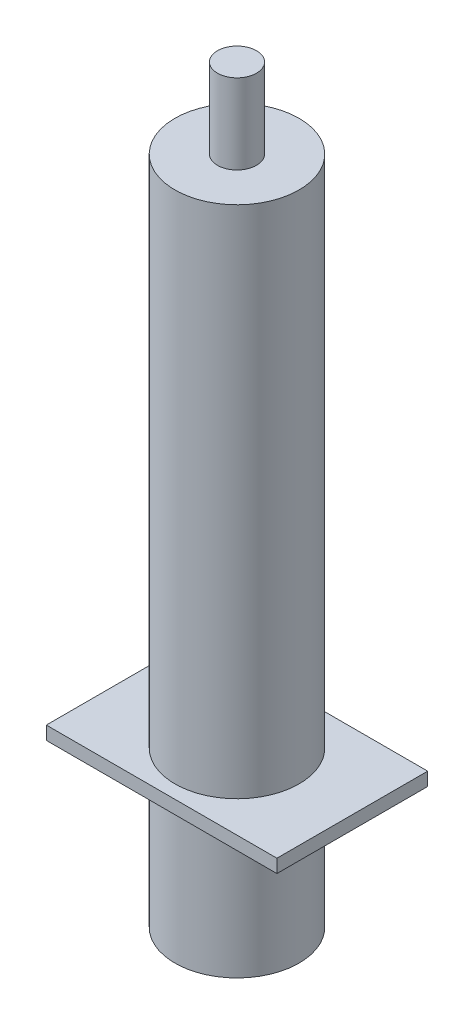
from build123d import *

# Parameters (mm, degrees)
SKETCH_1_R      = 7
EXTRUDE_1_DEPTH = 58
SKETCH_2_R      = 2.2
EXTRUDE_2_DEPTH = 9
SKETCH_3_W      = 26
SKETCH_3_H      = 17
EXTRUDE_3_DEPTH = 1.5
EXTRUDE_START   = 16
SKETCH_4_R      = 7
EXTRUDE_4_DEPTH = 16


with BuildPart() as part:
    # Sketch 1 → Extrude 1 (new body)
    with BuildSketch(Plane(origin=(0, 0, 0), x_dir=(1, 0, 0), z_dir=(0, 1, 0))):
        with Locations(Location((0, 0, 0), (0, 0, 90))):
            Circle(SKETCH_1_R)
    extrude(amount=EXTRUDE_1_DEPTH)

    # Sketch 2 → Extrude 2 (add)
    with BuildSketch(Plane(origin=(0, 58, 0), x_dir=(1, 0, 0), z_dir=(0, 1, 0))):
        with Locations(Location((0, 0, 0), (0, 0, 270))):
            Circle(SKETCH_2_R)
    extrude(amount=EXTRUDE_2_DEPTH)

    # Sketch 3 → Extrude 3 (add)
    with BuildSketch(Plane.XZ):
        Rectangle(SKETCH_3_W, SKETCH_3_H)
    extrude(amount=EXTRUDE_3_DEPTH)

    # Sketch 4 → Extrude 4 (add)
    with BuildSketch(Plane.XZ.offset(1.5).offset(EXTRUDE_START)):
        with Locations(Location((0, 0, 0), (0, 0, 270))):
            Circle(SKETCH_4_R)
    extrude(amount=-EXTRUDE_4_DEPTH)


solid = part.part
